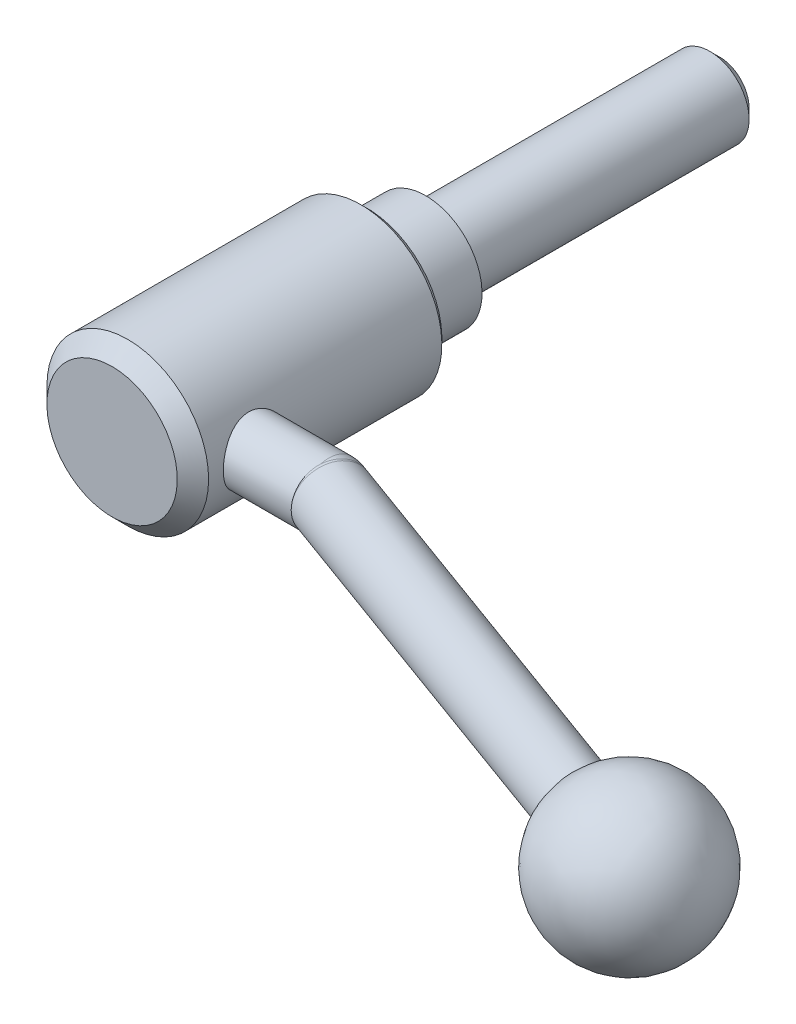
ISO-10303-21;
HEADER;
FILE_DESCRIPTION(('STEP AP214'),'2;1');
FILE_NAME('part.step','',(''),(''),'','','');
FILE_SCHEMA(('AUTOMOTIVE_DESIGN { 1 0 10303 214 1 1 1 1 }'));
ENDSEC;
DATA;
#1=APPLICATION_CONTEXT('core data for automotive mechanical design processes');
#2=APPLICATION_PROTOCOL_DEFINITION('international standard','automotive_design',2000,#1);
#3=PRODUCT_CONTEXT('',#1,'mechanical');
#4=PRODUCT('Part','Part','',(#3));
#5=PRODUCT_RELATED_PRODUCT_CATEGORY('part','',(#4));
#6=PRODUCT_DEFINITION_FORMATION('','',#4);
#7=PRODUCT_DEFINITION_CONTEXT('part definition',#1,'design');
#8=PRODUCT_DEFINITION('design','',#6,#7);
#9=PRODUCT_DEFINITION_SHAPE('','',#8);
#10=(LENGTH_UNIT() NAMED_UNIT(*) SI_UNIT(.MILLI.,.METRE.));
#11=(NAMED_UNIT(*) PLANE_ANGLE_UNIT() SI_UNIT($,.RADIAN.));
#12=(NAMED_UNIT(*) SI_UNIT($,.STERADIAN.) SOLID_ANGLE_UNIT());
#13=UNCERTAINTY_MEASURE_WITH_UNIT(LENGTH_MEASURE(1.E-05),#10,'distance_accuracy_value','');
#14=(GEOMETRIC_REPRESENTATION_CONTEXT(3) GLOBAL_UNCERTAINTY_ASSIGNED_CONTEXT((#13)) GLOBAL_UNIT_ASSIGNED_CONTEXT((#10,
#11,#12)) REPRESENTATION_CONTEXT('',''));
#15=CARTESIAN_POINT('',(0.,0.,0.));
#16=DIRECTION('',(0.,0.,1.));
#17=DIRECTION('',(1.,0.,0.));
#18=AXIS2_PLACEMENT_3D('',#15,#16,#17);
#19=CARTESIAN_POINT('',(0.,0.,-14.386565));
#20=DIRECTION('',(0.,0.,1.));
#21=DIRECTION('',(0.,-1.,0.));
#22=AXIS2_PLACEMENT_3D('',#19,#20,#21);
#23=CYLINDRICAL_SURFACE('',#22,8.);
#24=CARTESIAN_POINT('',(0.,0.,-58.));
#25=DIRECTION('',(0.,0.,-1.));
#26=DIRECTION('',(-1.,0.,0.));
#27=AXIS2_PLACEMENT_3D('',#24,#25,#26);
#28=CIRCLE('',#27,8.);
#29=CARTESIAN_POINT('',(-8.,0.,-58.));
#30=VERTEX_POINT('',#29);
#31=EDGE_CURVE('E9',#30,#30,#28,.F.);
#32=ORIENTED_EDGE('',*,*,#31,.T.);
#33=EDGE_LOOP('',(#32));
#34=FACE_BOUND('',#33,.T.);
#35=CARTESIAN_POINT('',(0.,0.,0.));
#36=DIRECTION('',(0.,0.,1.));
#37=DIRECTION('',(0.,-1.,0.));
#38=AXIS2_PLACEMENT_3D('',#35,#36,#37);
#39=CIRCLE('',#38,8.);
#40=CARTESIAN_POINT('',(0.,-8.,0.));
#41=VERTEX_POINT('',#40);
#42=EDGE_CURVE('E144',#41,#41,#39,.T.);
#43=ORIENTED_EDGE('',*,*,#42,.F.);
#44=EDGE_LOOP('',(#43));
#45=FACE_BOUND('',#44,.T.);
#46=ADVANCED_FACE('F14',(#34,#45),#23,.T.);
#47=CARTESIAN_POINT('',(9.75,0.,0.));
#48=DIRECTION('',(0.,0.,-1.));
#49=DIRECTION('',(0.,1.,0.));
#50=AXIS2_PLACEMENT_3D('',#47,#48,#49);
#51=PLANE('',#50);
#52=ORIENTED_EDGE('',*,*,#42,.T.);
#53=EDGE_LOOP('',(#52));
#54=FACE_BOUND('',#53,.T.);
#55=CARTESIAN_POINT('',(0.,0.,0.));
#56=DIRECTION('',(0.,0.,1.));
#57=DIRECTION('',(0.,-1.,0.));
#58=AXIS2_PLACEMENT_3D('',#55,#56,#57);
#59=CIRCLE('',#58,11.5);
#60=CARTESIAN_POINT('',(0.,-11.5,0.));
#61=VERTEX_POINT('',#60);
#62=EDGE_CURVE('E141',#61,#61,#59,.T.);
#63=ORIENTED_EDGE('',*,*,#62,.F.);
#64=EDGE_LOOP('',(#63));
#65=FACE_BOUND('',#64,.T.);
#66=ADVANCED_FACE('F148',(#54,#65),#51,.T.);
#67=CARTESIAN_POINT('',(0.,0.,6.));
#68=DIRECTION('',(0.,0.,1.));
#69=DIRECTION('',(0.,-1.,0.));
#70=AXIS2_PLACEMENT_3D('',#67,#68,#69);
#71=CYLINDRICAL_SURFACE('',#70,11.5);
#72=CARTESIAN_POINT('',(0.,0.,12.));
#73=DIRECTION('',(0.,0.,1.));
#74=DIRECTION('',(0.,-1.,0.));
#75=AXIS2_PLACEMENT_3D('',#72,#73,#74);
#76=CIRCLE('',#75,11.5);
#77=CARTESIAN_POINT('',(0.,-11.5,12.));
#78=VERTEX_POINT('',#77);
#79=EDGE_CURVE('E136',#78,#78,#76,.T.);
#80=ORIENTED_EDGE('',*,*,#79,.F.);
#81=EDGE_LOOP('',(#80));
#82=FACE_BOUND('',#81,.T.);
#83=ORIENTED_EDGE('',*,*,#62,.T.);
#84=EDGE_LOOP('',(#83));
#85=FACE_BOUND('',#84,.T.);
#86=ADVANCED_FACE('F158',(#82,#85),#71,.T.);
#87=CARTESIAN_POINT('',(13.4,0.,12.));
#88=DIRECTION('',(0.,0.,-1.));
#89=DIRECTION('',(0.,1.,0.));
#90=AXIS2_PLACEMENT_3D('',#87,#88,#89);
#91=PLANE('',#90);
#92=ORIENTED_EDGE('',*,*,#79,.T.);
#93=EDGE_LOOP('',(#92));
#94=FACE_BOUND('',#93,.T.);
#95=CARTESIAN_POINT('',(0.,0.,12.));
#96=DIRECTION('',(0.,0.,1.));
#97=DIRECTION('',(0.,-1.,0.));
#98=AXIS2_PLACEMENT_3D('',#95,#96,#97);
#99=CIRCLE('',#98,15.3);
#100=CARTESIAN_POINT('',(0.,-15.3,12.));
#101=VERTEX_POINT('',#100);
#102=EDGE_CURVE('E134',#101,#101,#99,.T.);
#103=ORIENTED_EDGE('',*,*,#102,.F.);
#104=EDGE_LOOP('',(#103));
#105=FACE_BOUND('',#104,.T.);
#106=ADVANCED_FACE('F163',(#94,#105),#91,.T.);
#107=CARTESIAN_POINT('',(6.65,0.,64.));
#108=DIRECTION('',(0.,0.,1.));
#109=DIRECTION('',(0.,-1.,0.));
#110=AXIS2_PLACEMENT_3D('',#107,#108,#109);
#111=PLANE('',#110);
#112=CARTESIAN_POINT('',(0.,0.,64.));
#113=DIRECTION('',(0.,0.,-1.));
#114=DIRECTION('',(0.,1.,0.));
#115=AXIS2_PLACEMENT_3D('',#112,#113,#114);
#116=CIRCLE('',#115,13.3);
#117=CARTESIAN_POINT('',(0.,13.3,64.));
#118=VERTEX_POINT('',#117);
#119=EDGE_CURVE('E118',#118,#118,#116,.T.);
#120=ORIENTED_EDGE('',*,*,#119,.F.);
#121=EDGE_LOOP('',(#120));
#122=FACE_BOUND('',#121,.T.);
#123=ADVANCED_FACE('F167',(#122),#111,.T.);
#124=CARTESIAN_POINT('',(0.,0.,13.2));
#125=DIRECTION('',(0.,0.,1.));
#126=DIRECTION('',(0.,-1.,0.));
#127=AXIS2_PLACEMENT_3D('',#124,#125,#126);
#128=CONICAL_SURFACE('',#127,16.5,0.785398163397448);
#129=ORIENTED_EDGE('',*,*,#102,.T.);
#130=EDGE_LOOP('',(#129));
#131=FACE_BOUND('',#130,.T.);
#132=CARTESIAN_POINT('',(0.,0.,13.2));
#133=DIRECTION('',(0.,0.,1.));
#134=DIRECTION('',(0.,-1.,0.));
#135=AXIS2_PLACEMENT_3D('',#132,#133,#134);
#136=CIRCLE('',#135,16.5);
#137=CARTESIAN_POINT('',(0.,-16.5,13.2));
#138=VERTEX_POINT('',#137);
#139=EDGE_CURVE('E111',#138,#138,#136,.T.);
#140=ORIENTED_EDGE('',*,*,#139,.F.);
#141=EDGE_LOOP('',(#140));
#142=FACE_BOUND('',#141,.T.);
#143=ADVANCED_FACE('F129',(#131,#142),#128,.T.);
#144=CARTESIAN_POINT('',(0.,0.,60.8));
#145=DIRECTION('',(0.,0.,-1.));
#146=DIRECTION('',(0.,1.,0.));
#147=AXIS2_PLACEMENT_3D('',#144,#145,#146);
#148=CONICAL_SURFACE('',#147,16.5,0.785398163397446);
#149=CARTESIAN_POINT('',(0.,0.,60.8));
#150=DIRECTION('',(0.,0.,1.));
#151=DIRECTION('',(0.,-1.,0.));
#152=AXIS2_PLACEMENT_3D('',#149,#150,#151);
#153=CIRCLE('',#152,16.5);
#154=CARTESIAN_POINT('',(0.,-16.5,60.8));
#155=VERTEX_POINT('',#154);
#156=EDGE_CURVE('E47',#155,#155,#153,.F.);
#157=ORIENTED_EDGE('',*,*,#156,.F.);
#158=EDGE_LOOP('',(#157));
#159=FACE_BOUND('',#158,.T.);
#160=ORIENTED_EDGE('',*,*,#119,.T.);
#161=EDGE_LOOP('',(#160));
#162=FACE_BOUND('',#161,.T.);
#163=ADVANCED_FACE('F126',(#159,#162),#148,.T.);
#164=CARTESIAN_POINT('',(0.,0.,37.));
#165=DIRECTION('',(0.,0.,1.));
#166=DIRECTION('',(0.,-1.,0.));
#167=AXIS2_PLACEMENT_3D('',#164,#165,#166);
#168=CYLINDRICAL_SURFACE('',#167,16.5);
#169=ORIENTED_EDGE('',*,*,#139,.T.);
#170=EDGE_LOOP('',(#169));
#171=FACE_BOUND('',#170,.T.);
#172=ORIENTED_EDGE('',*,*,#156,.T.);
#173=EDGE_LOOP('',(#172));
#174=FACE_BOUND('',#173,.T.);
#175=CARTESIAN_POINT('',(15.1657508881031,-6.5,51.3));
#176=CARTESIAN_POINT('',(15.165745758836,-6.50000508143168,51.1253356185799));
#177=CARTESIAN_POINT('',(15.1687745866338,-6.4929568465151,50.9507222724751));
#178=CARTESIAN_POINT('',(15.1807749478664,-6.46485327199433,50.6027802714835));
#179=CARTESIAN_POINT('',(15.1897474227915,-6.44379571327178,50.4294518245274));
#180=CARTESIAN_POINT('',(15.2133459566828,-6.38788044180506,50.0853414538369));
#181=CARTESIAN_POINT('',(15.2279750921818,-6.35301521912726,49.9145609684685));
#182=CARTESIAN_POINT('',(15.2624132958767,-6.26982978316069,49.5767762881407));
#183=CARTESIAN_POINT('',(15.2822244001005,-6.22150428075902,49.4097736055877));
#184=CARTESIAN_POINT('',(15.3263261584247,-6.1120529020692,49.0812888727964));
#185=CARTESIAN_POINT('',(15.3506010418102,-6.05097199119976,48.919789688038));
#186=CARTESIAN_POINT('',(15.4029664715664,-5.91640387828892,48.6026208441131));
#187=CARTESIAN_POINT('',(15.4310584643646,-5.84291197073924,48.4469534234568));
#188=CARTESIAN_POINT('',(15.4902542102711,-5.68411811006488,48.1424245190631));
#189=CARTESIAN_POINT('',(15.5213571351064,-5.59881940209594,47.9935611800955));
#190=CARTESIAN_POINT('',(15.5857641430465,-5.4169422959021,47.7033239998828));
#191=CARTESIAN_POINT('',(15.6190690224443,-5.32035980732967,47.5619529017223));
#192=CARTESIAN_POINT('',(15.6887193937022,-5.11143835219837,47.2806209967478));
#193=CARTESIAN_POINT('',(15.725133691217,-4.99855381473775,47.14108210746));
#194=CARTESIAN_POINT('',(15.7984639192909,-4.76171225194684,46.8718807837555));
#195=CARTESIAN_POINT('',(15.8353798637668,-4.63775491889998,46.7422186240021));
#196=CARTESIAN_POINT('',(15.9087667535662,-4.37940403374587,46.4934424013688));
#197=CARTESIAN_POINT('',(15.9452374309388,-4.24500452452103,46.3743344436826));
#198=CARTESIAN_POINT('',(16.0167560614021,-3.96663185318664,46.1475194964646));
#199=CARTESIAN_POINT('',(16.0518045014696,-3.8226620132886,46.0398085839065));
#200=CARTESIAN_POINT('',(16.1209091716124,-3.52012556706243,45.8324927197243));
#201=CARTESIAN_POINT('',(16.1548735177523,-3.36120877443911,45.7333671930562));
#202=CARTESIAN_POINT('',(16.219333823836,-3.03493842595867,45.5489784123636));
#203=CARTESIAN_POINT('',(16.2498311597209,-2.86758825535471,45.4637096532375));
#204=CARTESIAN_POINT('',(16.3064735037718,-2.52565072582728,45.3078089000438));
#205=CARTESIAN_POINT('',(16.3326221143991,-2.35106950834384,45.2371647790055));
#206=CARTESIAN_POINT('',(16.3798219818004,-1.99588359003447,45.1111415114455));
#207=CARTESIAN_POINT('',(16.4008745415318,-1.81528044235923,45.0557584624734));
#208=CARTESIAN_POINT('',(16.4454357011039,-1.36695920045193,44.9394592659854));
#209=CARTESIAN_POINT('',(16.4657881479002,-1.09660341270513,44.8872635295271));
#210=CARTESIAN_POINT('',(16.4930664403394,-0.550789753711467,44.8175398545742));
#211=CARTESIAN_POINT('',(16.4999939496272,-0.275332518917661,44.800007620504));
#212=CARTESIAN_POINT('',(16.5000038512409,0.175257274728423,44.7999951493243));
#213=CARTESIAN_POINT('',(16.4972033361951,0.350464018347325,44.8070907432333));
#214=CARTESIAN_POINT('',(16.4860855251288,0.699610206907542,44.8353885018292));
#215=CARTESIAN_POINT('',(16.4777673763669,0.873549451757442,44.8565928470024));
#216=CARTESIAN_POINT('',(16.4558274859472,1.21889636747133,44.9129094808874));
#217=CARTESIAN_POINT('',(16.4422032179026,1.39030279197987,44.9480283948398));
#218=CARTESIAN_POINT('',(16.4100071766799,1.72935619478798,45.0318397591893));
#219=CARTESIAN_POINT('',(16.3914335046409,1.8970017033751,45.0805374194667));
#220=CARTESIAN_POINT('',(16.3498830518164,2.22685454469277,45.1908856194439));
#221=CARTESIAN_POINT('',(16.3269192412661,2.38907628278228,45.2524980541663));
#222=CARTESIAN_POINT('',(16.2771221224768,2.70763704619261,45.3882581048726));
#223=CARTESIAN_POINT('',(16.2502873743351,2.86397385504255,45.4624103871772));
#224=CARTESIAN_POINT('',(16.1934219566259,3.16974182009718,45.6226308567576));
#225=CARTESIAN_POINT('',(16.1633922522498,3.31917504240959,45.7086954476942));
#226=CARTESIAN_POINT('',(16.1008405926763,3.61041938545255,45.892180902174));
#227=CARTESIAN_POINT('',(16.0683177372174,3.752227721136,45.9896058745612));
#228=CARTESIAN_POINT('',(16.0001727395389,4.03314016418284,46.1994336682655));
#229=CARTESIAN_POINT('',(15.9644779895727,4.17188782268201,46.3122902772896));
#230=CARTESIAN_POINT('',(15.892142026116,4.43948611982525,46.5489090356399));
#231=CARTESIAN_POINT('',(15.8555007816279,4.56833643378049,46.6726715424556));
#232=CARTESIAN_POINT('',(15.7821969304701,4.81548386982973,46.9304447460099));
#233=CARTESIAN_POINT('',(15.7455343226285,4.93377545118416,47.0644607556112));
#234=CARTESIAN_POINT('',(15.6731846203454,5.15899919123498,47.3418892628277));
#235=CARTESIAN_POINT('',(15.6374972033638,5.26593514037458,47.4852985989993));
#236=CARTESIAN_POINT('',(15.5665464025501,5.4722064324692,47.7871932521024));
#237=CARTESIAN_POINT('',(15.5313687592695,5.57100992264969,47.9460628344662));
#238=CARTESIAN_POINT('',(15.4642240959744,5.75476702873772,48.2721837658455));
#239=CARTESIAN_POINT('',(15.4322557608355,5.83972632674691,48.4394316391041));
#240=CARTESIAN_POINT('',(15.3725571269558,5.99511642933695,48.7813028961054));
#241=CARTESIAN_POINT('',(15.3448272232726,6.06554587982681,48.9559269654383));
#242=CARTESIAN_POINT('',(15.2945852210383,6.19114229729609,49.311222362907));
#243=CARTESIAN_POINT('',(15.2720705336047,6.24631683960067,49.4918906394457));
#244=CARTESIAN_POINT('',(15.2339240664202,6.33876553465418,49.8499242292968));
#245=CARTESIAN_POINT('',(15.2180336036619,6.37671895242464,50.0270865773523));
#246=CARTESIAN_POINT('',(15.1923255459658,6.43772822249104,50.3843194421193));
#247=CARTESIAN_POINT('',(15.1825052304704,6.4607907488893,50.5643886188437));
#248=CARTESIAN_POINT('',(15.1692851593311,6.49176962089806,50.9260259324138));
#249=CARTESIAN_POINT('',(15.1658841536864,6.49968891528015,51.107593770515));
#250=CARTESIAN_POINT('',(15.1656253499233,6.50029305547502,51.4707553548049));
#251=CARTESIAN_POINT('',(15.1687672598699,6.49297858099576,51.6523490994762));
#252=CARTESIAN_POINT('',(15.1810465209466,6.4642126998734,52.0018533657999));
#253=CARTESIAN_POINT('',(15.1897653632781,6.44374768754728,52.169860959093));
#254=CARTESIAN_POINT('',(15.2125161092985,6.38985201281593,52.5034742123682));
#255=CARTESIAN_POINT('',(15.2265497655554,6.35641707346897,52.6690790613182));
#256=CARTESIAN_POINT('',(15.2594944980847,6.27691602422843,52.9966826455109));
#257=CARTESIAN_POINT('',(15.2784043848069,6.2308529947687,53.158682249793));
#258=CARTESIAN_POINT('',(15.3205529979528,6.12648519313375,53.4781720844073));
#259=CARTESIAN_POINT('',(15.3437933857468,6.06817572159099,53.6356605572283));
#260=CARTESIAN_POINT('',(15.3944388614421,5.93853407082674,53.9482065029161));
#261=CARTESIAN_POINT('',(15.4219169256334,5.86696813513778,54.103155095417));
#262=CARTESIAN_POINT('',(15.4799371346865,5.71212576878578,54.4065474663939));
#263=CARTESIAN_POINT('',(15.5104803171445,5.62884536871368,54.5549890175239));
#264=CARTESIAN_POINT('',(15.573821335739,5.45114518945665,54.8445557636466));
#265=CARTESIAN_POINT('',(15.6066193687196,5.35672443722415,54.9856803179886));
#266=CARTESIAN_POINT('',(15.6736444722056,5.15731826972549,55.2599004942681));
#267=CARTESIAN_POINT('',(15.7078716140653,5.05233232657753,55.392995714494));
#268=CARTESIAN_POINT('',(15.779514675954,4.82413356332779,55.6601446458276));
#269=CARTESIAN_POINT('',(15.8169774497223,4.70014455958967,55.7935237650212));
#270=CARTESIAN_POINT('',(15.8915700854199,4.44140964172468,56.0494187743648));
#271=CARTESIAN_POINT('',(15.9287000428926,4.3066669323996,56.171937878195));
#272=CARTESIAN_POINT('',(16.0016814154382,4.0270441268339,56.4054996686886));
#273=CARTESIAN_POINT('',(16.0375317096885,3.88215545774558,56.5165324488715));
#274=CARTESIAN_POINT('',(16.106952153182,3.58324186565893,56.7262041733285));
#275=CARTESIAN_POINT('',(16.1405232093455,3.42922062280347,56.8248480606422));
#276=CARTESIAN_POINT('',(16.20513395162,3.10977568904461,57.0108780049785));
#277=CARTESIAN_POINT('',(16.2361103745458,2.94418663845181,57.0980025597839));
#278=CARTESIAN_POINT('',(16.293877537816,2.60557789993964,57.2578518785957));
#279=CARTESIAN_POINT('',(16.3206700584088,2.43256141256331,57.3305827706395));
#280=CARTESIAN_POINT('',(16.3692672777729,2.08053032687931,57.4608897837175));
#281=CARTESIAN_POINT('',(16.3910795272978,1.90152528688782,57.5184888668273));
#282=CARTESIAN_POINT('',(16.4291085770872,1.53871493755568,57.6180476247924));
#283=CARTESIAN_POINT('',(16.4453277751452,1.35491172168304,57.6600140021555));
#284=CARTESIAN_POINT('',(16.4721817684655,0.976957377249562,57.7291390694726));
#285=CARTESIAN_POINT('',(16.4825841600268,0.782676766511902,57.7556829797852));
#286=CARTESIAN_POINT('',(16.4964929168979,0.392259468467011,57.7911129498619));
#287=CARTESIAN_POINT('',(16.4999993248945,0.196122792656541,57.7999991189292));
#288=CARTESIAN_POINT('',(16.5000006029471,-0.175160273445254,57.8000007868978));
#289=CARTESIAN_POINT('',(16.4972048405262,-0.350309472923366,57.7929141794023));
#290=CARTESIAN_POINT('',(16.4860972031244,-0.699350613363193,57.7646401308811));
#291=CARTESIAN_POINT('',(16.4777835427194,-0.873242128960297,57.7434481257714));
#292=CARTESIAN_POINT('',(16.4558494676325,-1.21860319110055,57.6871474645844));
#293=CARTESIAN_POINT('',(16.4422234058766,-1.39006995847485,57.6520239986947));
#294=CARTESIAN_POINT('',(16.4100199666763,-1.72924172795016,57.5681936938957));
#295=CARTESIAN_POINT('',(16.3914406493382,-1.89694522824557,57.5194815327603));
#296=CARTESIAN_POINT('',(16.3498814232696,-2.22686723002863,57.4091100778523));
#297=CARTESIAN_POINT('',(16.3269156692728,-2.38910145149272,57.3474923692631));
#298=CARTESIAN_POINT('',(16.2771139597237,-2.70768694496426,57.2117194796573));
#299=CARTESIAN_POINT('',(16.250276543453,-2.86403596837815,57.137559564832));
#300=CARTESIAN_POINT('',(16.1934100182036,-3.16980213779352,56.9773350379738));
#301=CARTESIAN_POINT('',(16.1633823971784,-3.31922246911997,56.8912759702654));
#302=CARTESIAN_POINT('',(16.100835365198,-3.61044218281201,56.7078034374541));
#303=CARTESIAN_POINT('',(16.0683150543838,-3.75223878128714,56.6103858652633));
#304=CARTESIAN_POINT('',(16.0001757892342,-4.03312759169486,56.400575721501));
#305=CARTESIAN_POINT('',(15.9644842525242,-4.17186347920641,56.2877295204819));
#306=CARTESIAN_POINT('',(15.8921547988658,-4.43944004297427,56.0511334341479));
#307=CARTESIAN_POINT('',(15.8555168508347,-4.56828039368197,55.9273831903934));
#308=CARTESIAN_POINT('',(15.7822130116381,-4.81543151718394,55.6696135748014));
#309=CARTESIAN_POINT('',(15.7455471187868,-4.93373489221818,55.5355871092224));
#310=CARTESIAN_POINT('',(15.673190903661,-5.15898035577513,55.2581360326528));
#311=CARTESIAN_POINT('',(15.6375002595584,-5.26592622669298,55.1147145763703));
#312=CARTESIAN_POINT('',(15.5665307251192,-5.47225204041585,54.8127398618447));
#313=CARTESIAN_POINT('',(15.5313383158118,-5.57109554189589,54.6537989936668));
#314=CARTESIAN_POINT('',(15.4641668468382,-5.75492139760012,54.3275284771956));
#315=CARTESIAN_POINT('',(15.4321865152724,-5.83990924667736,54.1602021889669));
#316=CARTESIAN_POINT('',(15.3724986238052,-5.9952660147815,53.8183316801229));
#317=CARTESIAN_POINT('',(15.3447872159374,-6.06564811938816,53.6437941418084));
#318=CARTESIAN_POINT('',(15.2945703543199,-6.191177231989,53.2886684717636));
#319=CARTESIAN_POINT('',(15.2720634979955,-6.24632834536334,53.1080819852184));
#320=CARTESIAN_POINT('',(15.2244373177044,-6.36176485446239,52.6609796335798));
#321=CARTESIAN_POINT('',(15.2025795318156,-6.41349655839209,52.3918451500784));
#322=CARTESIAN_POINT('',(15.1732415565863,-6.48260724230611,51.8484312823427));
#323=CARTESIAN_POINT('',(15.1657589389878,-6.49999202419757,51.574152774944));
#324=CARTESIAN_POINT('',(15.1657508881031,-6.5,51.3));
#325=B_SPLINE_CURVE_WITH_KNOTS('',3,(#175,#176,#177,#178,#179,#180,#181,#182,#183,#184,#185,
#186,#187,#188,#189,#190,#191,#192,#193,#194,#195,#196,#197,#198,#199,#200,#201,#202,#203,#204,
#205,#206,#207,#208,#209,#210,#211,#212,#213,#214,#215,#216,#217,#218,#219,#220,#221,#222,#223,
#224,#225,#226,#227,#228,#229,#230,#231,#232,#233,#234,#235,#236,#237,#238,#239,#240,#241,#242,
#243,#244,#245,#246,#247,#248,#249,#250,#251,#252,#253,#254,#255,#256,#257,#258,#259,#260,#261,
#262,#263,#264,#265,#266,#267,#268,#269,#270,#271,#272,#273,#274,#275,#276,#277,#278,#279,#280,
#281,#282,#283,#284,#285,#286,#287,#288,#289,#290,#291,#292,#293,#294,#295,#296,#297,#298,#299,
#300,#301,#302,#303,#304,#305,#306,#307,#308,#309,#310,#311,#312,#313,#314,#315,#316,#317,#318,
#319,#320,#321,#322,#323,#324),.UNSPECIFIED.,.T.,.F.,(4,2,2,2,2,2,2,2,2,2,2,2,2,2,2,2,2,2,2,2,2,
2,2,2,2,2,2,2,2,2,2,2,2,2,2,2,2,2,2,2,2,2,2,2,2,2,2,2,2,2,2,2,2,2,2,2,2,2,2,2,2,2,2,2,2,2,2,2,2,
2,2,2,2,2,4),(0.,0.523737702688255,1.04755838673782,1.57166436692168,2.09597658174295,
2.61847078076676,3.14116352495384,3.66371288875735,4.18645226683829,4.73526045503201,
5.28408389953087,5.83322277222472,6.38217200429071,6.95251243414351,7.5226257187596,
8.09226434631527,8.66175717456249,9.48746056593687,10.3130616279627,10.8385810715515,
11.3641817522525,11.890032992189,12.4160862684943,12.9406087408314,13.4653268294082,
13.9898868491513,14.5146371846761,15.0611644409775,15.6077096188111,16.1545399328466,
16.7011871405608,17.2715771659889,17.8417324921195,18.4119409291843,18.9818656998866,
19.5267807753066,20.0714514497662,20.6160160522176,21.1605563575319,21.6683825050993,
22.1763762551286,22.6842461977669,23.1923113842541,23.7103778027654,24.228620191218,
24.7469078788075,25.2652214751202,25.8223490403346,26.3793111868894,26.9367497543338,
27.4939651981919,28.0622107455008,28.6302138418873,29.1973499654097,29.7642426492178,
30.352408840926,30.9405713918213,31.4658683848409,31.991335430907,32.5173625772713,
33.0435960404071,33.5681592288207,34.0929208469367,34.6174387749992,35.1421469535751,
35.6886262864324,36.235123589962,36.7820016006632,37.3286969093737,37.8993337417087,
38.4697437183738,39.0396364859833,39.6093754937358,40.4315717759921,41.2536291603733),.UNSPECIFIED.);
#326=CARTESIAN_POINT('',(15.1657508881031,-6.5,51.3));
#327=VERTEX_POINT('',#326);
#328=EDGE_CURVE('E46',#327,#327,#325,.T.);
#329=ORIENTED_EDGE('',*,*,#328,.F.);
#330=EDGE_LOOP('',(#329));
#331=FACE_BOUND('',#330,.T.);
#332=ADVANCED_FACE('F123',(#171,#174,#331),#168,.T.);
#333=CARTESIAN_POINT('',(31.5,0.,51.3));
#334=DIRECTION('',(1.,0.,0.));
#335=DIRECTION('',(0.,0.,1.));
#336=AXIS2_PLACEMENT_3D('',#333,#334,#335);
#337=SPHERICAL_SURFACE('',#336,6.5);
#338=CARTESIAN_POINT('',(31.5,0.,51.3));
#339=DIRECTION('',(-1.,0.,0.));
#340=DIRECTION('',(0.,-1.,0.));
#341=AXIS2_PLACEMENT_3D('',#338,#339,#340);
#342=CIRCLE('',#341,6.5);
#343=CARTESIAN_POINT('',(31.5,6.28033613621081,52.9755232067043));
#344=VERTEX_POINT('',#343);
#345=CARTESIAN_POINT('',(31.5,-6.28033613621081,52.9755232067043));
#346=VERTEX_POINT('',#345);
#347=EDGE_CURVE('E35',#344,#346,#342,.T.);
#348=ORIENTED_EDGE('',*,*,#347,.F.);
#349=CARTESIAN_POINT('',(31.5,-6.28033613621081,52.9755232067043));
#350=CARTESIAN_POINT('',(31.5604115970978,-6.32463778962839,52.8095437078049));
#351=CARTESIAN_POINT('',(31.6214644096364,-6.3614496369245,52.6418024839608));
#352=CARTESIAN_POINT('',(31.7444103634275,-6.41991545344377,52.3040112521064));
#353=CARTESIAN_POINT('',(31.8063034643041,-6.44157014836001,52.133961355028));
#354=CARTESIAN_POINT('',(31.9304500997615,-6.46953783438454,51.7928712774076));
#355=CARTESIAN_POINT('',(31.9927033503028,-6.47586160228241,51.6218318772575));
#356=CARTESIAN_POINT('',(32.1171700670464,-6.47316004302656,51.2798623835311));
#357=CARTESIAN_POINT('',(32.1793835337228,-6.46413490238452,51.1089322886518));
#358=CARTESIAN_POINT('',(32.3033473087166,-6.43079358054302,50.768344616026));
#359=CARTESIAN_POINT('',(32.3650974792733,-6.4064730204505,50.598687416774));
#360=CARTESIAN_POINT('',(32.4877003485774,-6.34269837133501,50.2618388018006));
#361=CARTESIAN_POINT('',(32.5485527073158,-6.30323869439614,50.0946483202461));
#362=CARTESIAN_POINT('',(32.6688696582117,-6.20949357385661,49.764080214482));
#363=CARTESIAN_POINT('',(32.7283350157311,-6.15521652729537,49.6007004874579));
#364=CARTESIAN_POINT('',(32.8455127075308,-6.03218986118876,49.2787574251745));
#365=CARTESIAN_POINT('',(32.9032243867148,-5.96343490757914,49.1201958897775));
#366=CARTESIAN_POINT('',(33.0164417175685,-5.8119796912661,48.809133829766));
#367=CARTESIAN_POINT('',(33.0719481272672,-5.72928427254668,48.6566312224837));
#368=CARTESIAN_POINT('',(33.1804017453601,-5.55048605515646,48.3586573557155));
#369=CARTESIAN_POINT('',(33.2333480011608,-5.45437831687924,48.2131887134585));
#370=CARTESIAN_POINT('',(33.3362716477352,-5.2494843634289,47.9304083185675));
#371=CARTESIAN_POINT('',(33.3862496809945,-5.14070090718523,47.7930948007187));
#372=CARTESIAN_POINT('',(33.4829120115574,-4.91116949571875,47.5275172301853));
#373=CARTESIAN_POINT('',(33.5295950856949,-4.79041713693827,47.3992565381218));
#374=CARTESIAN_POINT('',(33.6192965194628,-4.53789283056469,47.1528038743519));
#375=CARTESIAN_POINT('',(33.662316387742,-4.40612546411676,47.0346077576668));
#376=CARTESIAN_POINT('',(33.7444224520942,-4.13241387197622,46.8090231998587));
#377=CARTESIAN_POINT('',(33.7835071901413,-3.99046590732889,46.7016387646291));
#378=CARTESIAN_POINT('',(33.85743093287,-3.69750906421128,46.4985349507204));
#379=CARTESIAN_POINT('',(33.8922717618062,-3.54650412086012,46.4028105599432));
#380=CARTESIAN_POINT('',(33.9574917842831,-3.23639397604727,46.2236200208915));
#381=CARTESIAN_POINT('',(33.9878693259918,-3.07728580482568,46.1401584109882));
#382=CARTESIAN_POINT('',(34.043921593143,-2.75220747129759,45.9861560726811));
#383=CARTESIAN_POINT('',(34.0695979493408,-2.58623971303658,45.9156108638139));
#384=CARTESIAN_POINT('',(34.1160870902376,-2.2485120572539,45.7878829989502));
#385=CARTESIAN_POINT('',(34.1368980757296,-2.07675004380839,45.7307052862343));
#386=CARTESIAN_POINT('',(34.1734894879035,-1.72875737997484,45.6301712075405));
#387=CARTESIAN_POINT('',(34.1892716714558,-1.55252831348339,45.5868100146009));
#388=CARTESIAN_POINT('',(34.2157095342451,-1.19679469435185,45.5141725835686));
#389=CARTESIAN_POINT('',(34.2263633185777,-1.01728895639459,45.484901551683));
#390=CARTESIAN_POINT('',(34.2504829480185,-0.47589972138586,45.4186334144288));
#391=CARTESIAN_POINT('',(34.256147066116,-0.110762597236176,45.4030713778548));
#392=CARTESIAN_POINT('',(34.2464222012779,0.616910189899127,45.4297902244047));
#393=CARTESIAN_POINT('',(34.2310332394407,0.979445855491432,45.4720710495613));
#394=CARTESIAN_POINT('',(34.1796583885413,1.6918734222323,45.6132222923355));
#395=CARTESIAN_POINT('',(34.1436723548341,2.04176523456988,45.7120931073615));
#396=CARTESIAN_POINT('',(34.0521201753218,2.71889949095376,45.9636306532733));
#397=CARTESIAN_POINT('',(33.9965542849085,3.0461422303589,46.1162966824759));
#398=CARTESIAN_POINT('',(33.8674217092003,3.66870864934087,46.4710855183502));
#399=CARTESIAN_POINT('',(33.7938552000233,3.96403264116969,46.6732078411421));
#400=CARTESIAN_POINT('',(33.6308061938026,4.51438637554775,47.1211813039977));
#401=CARTESIAN_POINT('',(33.541323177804,4.76941480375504,47.3670338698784));
#402=CARTESIAN_POINT('',(33.3489838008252,5.23192699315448,47.8954819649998));
#403=CARTESIAN_POINT('',(33.2461274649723,5.43941084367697,48.1780774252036));
#404=CARTESIAN_POINT('',(33.0299624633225,5.80093835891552,48.7719858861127));
#405=CARTESIAN_POINT('',(32.916654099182,5.9549835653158,49.083298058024));
#406=CARTESIAN_POINT('',(32.6827891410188,6.20528929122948,49.7258367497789));
#407=CARTESIAN_POINT('',(32.5622315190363,6.30154159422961,50.0570660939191));
#408=CARTESIAN_POINT('',(32.3173112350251,6.43346974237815,50.7299790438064));
#409=CARTESIAN_POINT('',(32.1929495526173,6.46916105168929,51.0716599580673));
#410=CARTESIAN_POINT('',(31.9727599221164,6.47789082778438,51.6766259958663));
#411=CARTESIAN_POINT('',(31.876974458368,6.46349392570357,51.9397943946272));
#412=CARTESIAN_POINT('',(31.7344650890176,6.41489914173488,52.3313356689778));
#413=CARTESIAN_POINT('',(31.687169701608,6.39421043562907,52.4612786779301));
#414=CARTESIAN_POINT('',(31.5931272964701,6.34392911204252,52.7196580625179));
#415=CARTESIAN_POINT('',(31.5463803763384,6.31433493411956,52.8480941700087));
#416=CARTESIAN_POINT('',(31.5,6.28033613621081,52.9755232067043));
#417=B_SPLINE_CURVE_WITH_KNOTS('',3,(#349,#350,#351,#352,#353,#354,#355,#356,#357,#358,#359,
#360,#361,#362,#363,#364,#365,#366,#367,#368,#369,#370,#371,#372,#373,#374,#375,#376,#377,#378,
#379,#380,#381,#382,#383,#384,#385,#386,#387,#388,#389,#390,#391,#392,#393,#394,#395,#396,#397,
#398,#399,#400,#401,#402,#403,#404,#405,#406,#407,#408,#409,#410,#411,#412,#413,#414,#415,#416),
.UNSPECIFIED.,.F.,.F.,(4,2,2,2,2,2,2,2,2,2,2,2,2,2,2,2,2,2,2,2,2,2,2,2,2,2,2,2,2,2,2,2,2,4),(0.,
0.546141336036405,1.09225652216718,1.63798770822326,2.1837122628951,2.72959312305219,
3.27567566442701,3.82144937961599,4.36742452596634,4.91321034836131,5.45919771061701,
6.0050664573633,6.55113678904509,7.09698112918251,7.64302697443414,8.18883726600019,
8.73484905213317,9.28067107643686,9.82669462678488,10.3725272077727,10.918561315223,
12.0094472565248,13.100332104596,14.1912246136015,15.2821028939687,16.3729705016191,
17.4638736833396,18.5547748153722,19.645644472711,20.7366691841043,21.827415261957,
22.6662852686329,23.0854882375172,23.5047647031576),.UNSPECIFIED.);
#418=EDGE_CURVE('E49',#346,#344,#417,.T.);
#419=ORIENTED_EDGE('',*,*,#418,.F.);
#420=EDGE_LOOP('',(#348,#419));
#421=FACE_BOUND('',#420,.T.);
#422=ADVANCED_FACE('F50',(#421),#337,.T.);
#423=CARTESIAN_POINT('',(15.75,0.,51.3));
#424=DIRECTION('',(-1.,0.,0.));
#425=DIRECTION('',(0.,-1.,0.));
#426=AXIS2_PLACEMENT_3D('',#423,#424,#425);
#427=CYLINDRICAL_SURFACE('',#426,6.5);
#428=CARTESIAN_POINT('',(30.353874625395,0.,57.8));
#429=CARTESIAN_POINT('',(30.3538760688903,-0.180413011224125,57.8000209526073));
#430=CARTESIAN_POINT('',(30.3551991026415,-0.360822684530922,57.7924896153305));
#431=CARTESIAN_POINT('',(30.3604984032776,-0.72034373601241,57.7624738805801));
#432=CARTESIAN_POINT('',(30.3644745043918,-0.899455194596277,57.7399904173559));
#433=CARTESIAN_POINT('',(30.3750867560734,-1.25500271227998,57.6802401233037));
#434=CARTESIAN_POINT('',(30.3817212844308,-1.43144033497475,57.6429823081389));
#435=CARTESIAN_POINT('',(30.3976715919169,-1.78049689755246,57.5539799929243));
#436=CARTESIAN_POINT('',(30.4069873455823,-1.95311587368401,57.5022356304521));
#437=CARTESIAN_POINT('',(30.42833245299,-2.29333224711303,57.384654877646));
#438=CARTESIAN_POINT('',(30.4403620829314,-2.46092913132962,57.3188170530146));
#439=CARTESIAN_POINT('',(30.4671848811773,-2.7899775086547,57.173532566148));
#440=CARTESIAN_POINT('',(30.481979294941,-2.95142619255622,57.0940797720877));
#441=CARTESIAN_POINT('',(30.5143835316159,-3.26691386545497,56.9222351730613));
#442=CARTESIAN_POINT('',(30.5319923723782,-3.42095541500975,56.8298478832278));
#443=CARTESIAN_POINT('',(30.5701035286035,-3.72055534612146,56.6328784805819));
#444=CARTESIAN_POINT('',(30.5906045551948,-3.86611746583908,56.5283018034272));
#445=CARTESIAN_POINT('',(30.6347023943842,-4.14837693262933,56.3073163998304));
#446=CARTESIAN_POINT('',(30.6583107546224,-4.28503822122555,56.1908639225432));
#447=CARTESIAN_POINT('',(30.7087165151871,-4.5479574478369,55.9473847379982));
#448=CARTESIAN_POINT('',(30.7355139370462,-4.67421531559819,55.8203579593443));
#449=CARTESIAN_POINT('',(30.7925196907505,-4.9155279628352,55.5567044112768));
#450=CARTESIAN_POINT('',(30.8227291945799,-5.0305788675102,55.420074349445));
#451=CARTESIAN_POINT('',(30.8868489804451,-5.24868401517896,55.1383648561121));
#452=CARTESIAN_POINT('',(30.9207592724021,-5.35173822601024,54.9932854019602));
#453=CARTESIAN_POINT('',(30.991944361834,-5.54315969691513,54.6990494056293));
#454=CARTESIAN_POINT('',(31.0291330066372,-5.6317911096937,54.5500436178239));
#455=CARTESIAN_POINT('',(31.1080482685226,-5.79644456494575,54.2463609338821));
#456=CARTESIAN_POINT('',(31.1497744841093,-5.87246772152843,54.0916845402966));
#457=CARTESIAN_POINT('',(31.2164453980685,-5.97675614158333,53.8565126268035));
#458=CARTESIAN_POINT('',(31.2393571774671,-6.00990348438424,53.7775703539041));
#459=CARTESIAN_POINT('',(31.2867125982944,-6.07291452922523,53.6188354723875));
#460=CARTESIAN_POINT('',(31.311156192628,-6.10277833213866,53.5390428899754));
#461=CARTESIAN_POINT('',(31.361785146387,-6.15920167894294,53.3788091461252));
#462=CARTESIAN_POINT('',(31.3879711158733,-6.18576005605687,53.2983677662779));
#463=CARTESIAN_POINT('',(31.4423816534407,-6.23554888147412,53.1371353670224));
#464=CARTESIAN_POINT('',(31.4706064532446,-6.25877895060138,53.0563443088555));
#465=CARTESIAN_POINT('',(31.5,-6.28033613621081,52.9755232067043));
#466=B_SPLINE_CURVE_WITH_KNOTS('',3,(#428,#429,#430,#431,#432,#433,#434,#435,#436,#437,#438,
#439,#440,#441,#442,#443,#444,#445,#446,#447,#448,#449,#450,#451,#452,#453,#454,#455,#456,#457,
#458,#459,#460,#461,#462,#463,#464,#465),.UNSPECIFIED.,.F.,.F.,(4,2,2,2,2,2,2,2,2,2,2,2,2,2,2,2,
2,2,4),(0.,0.541072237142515,1.0821106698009,1.62281945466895,2.16352310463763,2.70428180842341,
3.24528469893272,3.78609920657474,4.32667346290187,4.86931655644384,5.41196331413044,
5.95479703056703,6.49763220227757,7.02900626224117,7.56033334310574,7.82616473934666,
8.09198796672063,8.3579047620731,8.62385182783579),.UNSPECIFIED.);
#467=CARTESIAN_POINT('',(30.3538746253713,0.,57.8));
#468=VERTEX_POINT('',#467);
#469=EDGE_CURVE('E42',#468,#346,#466,.T.);
#470=ORIENTED_EDGE('',*,*,#469,.F.);
#471=CARTESIAN_POINT('',(31.5,6.28033613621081,52.9755232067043));
#472=CARTESIAN_POINT('',(31.4799917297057,6.26566740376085,53.0305088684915));
#473=CARTESIAN_POINT('',(31.4605350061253,6.2502263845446,53.0854833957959));
#474=CARTESIAN_POINT('',(31.422614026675,6.21780122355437,53.1953164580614));
#475=CARTESIAN_POINT('',(31.404149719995,6.20081716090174,53.2501749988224));
#476=CARTESIAN_POINT('',(31.350095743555,6.14756914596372,53.4143861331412));
#477=CARTESIAN_POINT('',(31.315823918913,6.10899372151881,53.5234330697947));
#478=CARTESIAN_POINT('',(31.2502052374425,6.02574752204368,53.7400479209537));
#479=CARTESIAN_POINT('',(31.2188581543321,5.98107721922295,53.8476159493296));
#480=CARTESIAN_POINT('',(31.1586887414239,5.88575616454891,54.0607044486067));
#481=CARTESIAN_POINT('',(31.129864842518,5.8351091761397,54.1662261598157));
#482=CARTESIAN_POINT('',(31.0744189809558,5.72792472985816,54.3748382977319));
#483=CARTESIAN_POINT('',(31.0477971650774,5.67138687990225,54.4779285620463));
#484=CARTESIAN_POINT('',(30.9965376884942,5.55256954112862,54.6812483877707));
#485=CARTESIAN_POINT('',(30.9719000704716,5.49028992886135,54.7814778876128));
#486=CARTESIAN_POINT('',(30.9126002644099,5.327689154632,55.0278762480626));
#487=CARTESIAN_POINT('',(30.8790640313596,5.22388206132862,55.1720360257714));
#488=CARTESIAN_POINT('',(30.8156523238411,5.00438458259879,55.451838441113));
#489=CARTESIAN_POINT('',(30.7857767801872,4.88869442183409,55.5874812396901));
#490=CARTESIAN_POINT('',(30.7294047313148,4.64620709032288,55.8491274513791));
#491=CARTESIAN_POINT('',(30.7029071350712,4.51941352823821,55.9751339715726));
#492=CARTESIAN_POINT('',(30.6530744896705,4.25553131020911,56.2165469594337));
#493=CARTESIAN_POINT('',(30.6297394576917,4.11844259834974,56.3319533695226));
#494=CARTESIAN_POINT('',(30.5858558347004,3.83342873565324,56.5523913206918));
#495=CARTESIAN_POINT('',(30.5653385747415,3.68540613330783,56.657303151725));
#496=CARTESIAN_POINT('',(30.527257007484,3.38076547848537,56.8545811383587));
#497=CARTESIAN_POINT('',(30.5096940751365,3.22414346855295,56.9469414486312));
#498=CARTESIAN_POINT('',(30.4774435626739,2.90342410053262,57.1183503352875));
#499=CARTESIAN_POINT('',(30.4627569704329,2.73932419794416,57.1973943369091));
#500=CARTESIAN_POINT('',(30.4362115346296,2.4049534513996,57.3414668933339));
#501=CARTESIAN_POINT('',(30.4243513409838,2.23468559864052,57.4065021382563));
#502=CARTESIAN_POINT('',(30.4038395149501,1.89629760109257,57.5196908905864));
#503=CARTESIAN_POINT('',(30.3950753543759,1.72838048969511,57.5684319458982));
#504=CARTESIAN_POINT('',(30.3800690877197,1.38906161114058,57.6522477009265));
#505=CARTESIAN_POINT('',(30.373826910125,1.21765994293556,57.6873227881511));
#506=CARTESIAN_POINT('',(30.3638445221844,0.872477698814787,57.7435510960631));
#507=CARTESIAN_POINT('',(30.3601048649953,0.698696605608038,57.764701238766));
#508=CARTESIAN_POINT('',(30.3551204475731,0.349944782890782,57.792935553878));
#509=CARTESIAN_POINT('',(30.3538759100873,0.174973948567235,57.8000184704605));
#510=CARTESIAN_POINT('',(30.353874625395,0.,57.8));
#511=B_SPLINE_CURVE_WITH_KNOTS('',3,(#471,#472,#473,#474,#475,#476,#477,#478,#479,#480,#481,
#482,#483,#484,#485,#486,#487,#488,#489,#490,#491,#492,#493,#494,#495,#496,#497,#498,#499,#500,
#501,#502,#503,#504,#505,#506,#507,#508,#509,#510),.UNSPECIFIED.,.F.,.F.,(4,2,2,2,2,2,2,2,2,2,2,
2,2,2,2,2,2,2,2,4),(0.,0.1809535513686,0.361897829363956,0.723593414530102,1.0852609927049,
1.44670203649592,1.8081671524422,2.16964004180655,2.71132455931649,3.25299883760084,
3.79449771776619,4.3359995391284,4.88310452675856,5.43046343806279,5.97801001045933,
6.52529451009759,7.04991611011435,7.57452283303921,8.09924547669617,8.6240149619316),.UNSPECIFIED.);
#512=EDGE_CURVE('E44',#344,#468,#511,.T.);
#513=ORIENTED_EDGE('',*,*,#512,.F.);
#514=ORIENTED_EDGE('',*,*,#347,.T.);
#515=EDGE_LOOP('',(#470,#513,#514));
#516=FACE_BOUND('',#515,.T.);
#517=ORIENTED_EDGE('',*,*,#328,.T.);
#518=EDGE_LOOP('',(#517));
#519=FACE_BOUND('',#518,.T.);
#520=ADVANCED_FACE('F39',(#516,#519),#427,.T.);
#521=CARTESIAN_POINT('',(32.5770055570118,0.,51.6919979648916));
#522=DIRECTION('',(1.,0.,0.));
#523=DIRECTION('',(0.,0.,1.));
#524=AXIS2_PLACEMENT_3D('',#521,#522,#523);
#525=SPHERICAL_SURFACE('',#524,6.5);
#526=ORIENTED_EDGE('',*,*,#418,.T.);
#527=ORIENTED_EDGE('',*,*,#512,.T.);
#528=CARTESIAN_POINT('',(32.5770055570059,0.,51.6919979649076));
#529=DIRECTION('',(-0.939692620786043,0.,-0.342020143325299));
#530=DIRECTION('',(0.342020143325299,0.,-0.939692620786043));
#531=AXIS2_PLACEMENT_3D('',#528,#529,#530);
#532=CIRCLE('',#531,6.5);
#533=EDGE_CURVE('E55',#468,#468,#532,.F.);
#534=ORIENTED_EDGE('',*,*,#533,.F.);
#535=ORIENTED_EDGE('',*,*,#469,.T.);
#536=EDGE_LOOP('',(#526,#527,#534,#535));
#537=FACE_BOUND('',#536,.T.);
#538=ADVANCED_FACE('F54',(#537),#525,.T.);
#539=CARTESIAN_POINT('',(73.4192597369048,0.,66.557362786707));
#540=DIRECTION('',(-0.939692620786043,0.,-0.342020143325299));
#541=DIRECTION('',(0.342020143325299,0.,-0.939692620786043));
#542=AXIS2_PLACEMENT_3D('',#539,#540,#541);
#543=CYLINDRICAL_SURFACE('',#542,6.5);
#544=ORIENTED_EDGE('',*,*,#533,.T.);
#545=EDGE_LOOP('',(#544));
#546=FACE_BOUND('',#545,.T.);
#547=CARTESIAN_POINT('',(114.261513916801,0.,81.4227276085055));
#548=DIRECTION('',(-0.939692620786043,0.,-0.342020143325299));
#549=DIRECTION('',(0.342020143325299,0.,-0.939692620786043));
#550=AXIS2_PLACEMENT_3D('',#547,#548,#549);
#551=CIRCLE('',#550,6.5);
#552=CARTESIAN_POINT('',(116.484644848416,0.,75.3147255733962));
#553=VERTEX_POINT('',#552);
#554=EDGE_CURVE('E105',#553,#553,#551,.F.);
#555=ORIENTED_EDGE('',*,*,#554,.F.);
#556=EDGE_LOOP('',(#555));
#557=FACE_BOUND('',#556,.T.);
#558=ADVANCED_FACE('F81',(#546,#557),#543,.T.);
#559=CARTESIAN_POINT('',(128.,0.,86.4231276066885));
#560=DIRECTION('',(1.,0.,0.));
#561=DIRECTION('',(0.,0.,1.));
#562=AXIS2_PLACEMENT_3D('',#559,#560,#561);
#563=SPHERICAL_SURFACE('',#562,16.);
#564=CARTESIAN_POINT('',(144.,0.,86.4231276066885));
#565=VERTEX_POINT('',#564);
#566=VERTEX_LOOP('',#565);
#567=FACE_BOUND('',#566,.T.);
#568=ORIENTED_EDGE('',*,*,#554,.T.);
#569=EDGE_LOOP('',(#568));
#570=FACE_BOUND('',#569,.T.);
#571=ADVANCED_FACE('F90',(#567,#570),#563,.T.);
#572=CARTESIAN_POINT('',(0.,0.,-60.));
#573=DIRECTION('',(0.,0.,-1.));
#574=DIRECTION('',(-1.,0.,0.));
#575=AXIS2_PLACEMENT_3D('',#572,#573,#574);
#576=PLANE('',#575);
#577=CARTESIAN_POINT('',(0.,0.,-60.));
#578=DIRECTION('',(0.,0.,-1.));
#579=DIRECTION('',(-1.,0.,0.));
#580=AXIS2_PLACEMENT_3D('',#577,#578,#579);
#581=CIRCLE('',#580,6.);
#582=CARTESIAN_POINT('',(-6.,0.,-60.));
#583=VERTEX_POINT('',#582);
#584=EDGE_CURVE('E23',#583,#583,#581,.T.);
#585=ORIENTED_EDGE('',*,*,#584,.T.);
#586=EDGE_LOOP('',(#585));
#587=FACE_BOUND('',#586,.T.);
#588=ADVANCED_FACE('F92',(#587),#576,.T.);
#589=CARTESIAN_POINT('',(0.,0.,-60.));
#590=DIRECTION('',(0.,0.,1.));
#591=DIRECTION('',(1.,0.,0.));
#592=AXIS2_PLACEMENT_3D('',#589,#590,#591);
#593=CONICAL_SURFACE('',#592,6.,0.78539816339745);
#594=ORIENTED_EDGE('',*,*,#31,.F.);
#595=EDGE_LOOP('',(#594));
#596=FACE_BOUND('',#595,.T.);
#597=ORIENTED_EDGE('',*,*,#584,.F.);
#598=EDGE_LOOP('',(#597));
#599=FACE_BOUND('',#598,.T.);
#600=ADVANCED_FACE('F16',(#596,#599),#593,.T.);
#601=CLOSED_SHELL('',(#46,#66,#86,#106,#123,#143,#163,#332,#422,#520,#538,#558,#571,#588,#600));
#602=MANIFOLD_SOLID_BREP('B1',#601);
#603=ADVANCED_BREP_SHAPE_REPRESENTATION('',(#18,#602),#14);
#604=SHAPE_DEFINITION_REPRESENTATION(#9,#603);
ENDSEC;
END-ISO-10303-21;
